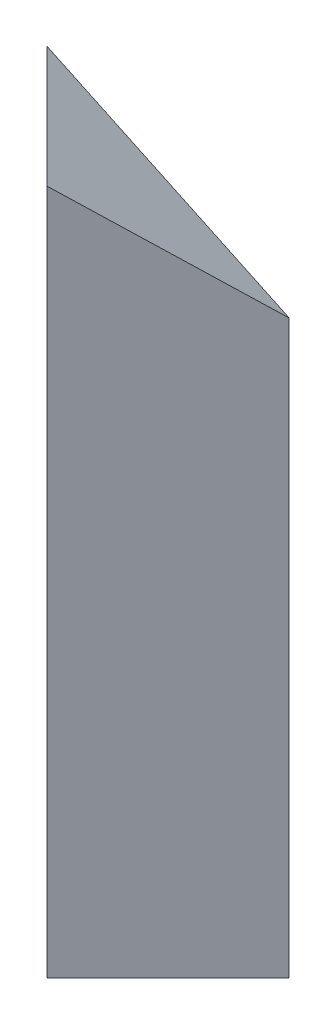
ISO-10303-21;
HEADER;
FILE_DESCRIPTION(('STEP AP214'),'2;1');
FILE_NAME('part.step','',(''),(''),'','','');
FILE_SCHEMA(('AUTOMOTIVE_DESIGN { 1 0 10303 214 1 1 1 1 }'));
ENDSEC;
DATA;
#1=APPLICATION_CONTEXT('core data for automotive mechanical design processes');
#2=APPLICATION_PROTOCOL_DEFINITION('international standard','automotive_design',2000,#1);
#3=PRODUCT_CONTEXT('',#1,'mechanical');
#4=PRODUCT('Part','Part','',(#3));
#5=PRODUCT_RELATED_PRODUCT_CATEGORY('part','',(#4));
#6=PRODUCT_DEFINITION_FORMATION('','',#4);
#7=PRODUCT_DEFINITION_CONTEXT('part definition',#1,'design');
#8=PRODUCT_DEFINITION('design','',#6,#7);
#9=PRODUCT_DEFINITION_SHAPE('','',#8);
#10=(LENGTH_UNIT() NAMED_UNIT(*) SI_UNIT(.MILLI.,.METRE.));
#11=(NAMED_UNIT(*) PLANE_ANGLE_UNIT() SI_UNIT($,.RADIAN.));
#12=(NAMED_UNIT(*) SI_UNIT($,.STERADIAN.) SOLID_ANGLE_UNIT());
#13=UNCERTAINTY_MEASURE_WITH_UNIT(LENGTH_MEASURE(1.E-05),#10,'distance_accuracy_value','');
#14=(GEOMETRIC_REPRESENTATION_CONTEXT(3) GLOBAL_UNCERTAINTY_ASSIGNED_CONTEXT((#13)) GLOBAL_UNIT_ASSIGNED_CONTEXT((#10,
#11,#12)) REPRESENTATION_CONTEXT('',''));
#15=CARTESIAN_POINT('',(0.,0.,0.));
#16=DIRECTION('',(0.,0.,1.));
#17=DIRECTION('',(1.,0.,0.));
#18=AXIS2_PLACEMENT_3D('',#15,#16,#17);
#19=CARTESIAN_POINT('',(-358.294753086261,26.8362503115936,79.0610038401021));
#20=DIRECTION('',(0.707106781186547,0.,0.707106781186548));
#21=DIRECTION('',(0.707106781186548,0.,-0.707106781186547));
#22=AXIS2_PLACEMENT_3D('',#19,#20,#21);
#23=PLANE('',#22);
#24=DIRECTION('',(-0.588348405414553,0.554700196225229,0.588348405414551));
#25=VECTOR('',#24,1.);
#26=CARTESIAN_POINT('',(-358.294753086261,26.8362503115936,79.0610038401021));
#27=LINE('',#26,#25);
#28=CARTESIAN_POINT('',(-354.759219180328,23.5029169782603,75.5254699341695));
#29=VERTEX_POINT('',#28);
#30=CARTESIAN_POINT('',(-358.294753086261,26.8362503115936,79.0610038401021));
#31=VERTEX_POINT('',#30);
#32=EDGE_CURVE('E34',#29,#31,#27,.T.);
#33=ORIENTED_EDGE('',*,*,#32,.T.);
#34=DIRECTION('',(0.,-1.,0.));
#35=VECTOR('',#34,1.);
#36=CARTESIAN_POINT('',(-358.294753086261,6.83625031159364,79.0610038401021));
#37=LINE('',#36,#35);
#38=CARTESIAN_POINT('',(-358.294753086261,6.83625031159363,79.0610038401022));
#39=VERTEX_POINT('',#38);
#40=EDGE_CURVE('E66',#31,#39,#37,.T.);
#41=ORIENTED_EDGE('',*,*,#40,.T.);
#42=DIRECTION('',(0.707106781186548,0.,-0.707106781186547));
#43=VECTOR('',#42,1.);
#44=CARTESIAN_POINT('',(-337.081549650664,6.83625031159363,57.8478004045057));
#45=LINE('',#44,#43);
#46=CARTESIAN_POINT('',(-354.759219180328,6.83625031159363,75.5254699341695));
#47=VERTEX_POINT('',#46);
#48=EDGE_CURVE('E59',#39,#47,#45,.T.);
#49=ORIENTED_EDGE('',*,*,#48,.T.);
#50=DIRECTION('',(0.,1.,0.));
#51=VECTOR('',#50,1.);
#52=CARTESIAN_POINT('',(-354.759219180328,15.6636709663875,75.5254699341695));
#53=LINE('',#52,#51);
#54=EDGE_CURVE('E49',#47,#29,#53,.T.);
#55=ORIENTED_EDGE('',*,*,#54,.T.);
#56=EDGE_LOOP('',(#33,#41,#49,#55));
#57=FACE_BOUND('',#56,.T.);
#58=ADVANCED_FACE('F31',(#57),#23,.T.);
#59=CARTESIAN_POINT('',(-358.294753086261,26.8362503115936,79.0610038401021));
#60=DIRECTION('',(-0.392232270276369,-0.832050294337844,0.392232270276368));
#61=DIRECTION('',(0.904534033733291,-0.426401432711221,0.));
#62=AXIS2_PLACEMENT_3D('',#59,#60,#61);
#63=PLANE('',#62);
#64=ORIENTED_EDGE('',*,*,#32,.F.);
#65=DIRECTION('',(0.904533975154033,-0.426401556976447,-3.22185604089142E-07));
#66=VECTOR('',#65,1.);
#67=CARTESIAN_POINT('',(-361.830284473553,26.8362503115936,75.5254724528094));
#68=LINE('',#67,#66);
#69=CARTESIAN_POINT('',(-361.830284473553,26.8362503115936,75.5254724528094));
#70=VERTEX_POINT('',#69);
#71=EDGE_CURVE('E80',#70,#29,#68,.T.);
#72=ORIENTED_EDGE('',*,*,#71,.F.);
#73=DIRECTION('',(-0.707106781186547,0.,-0.707106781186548));
#74=VECTOR('',#73,1.);
#75=CARTESIAN_POINT('',(-356.173432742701,26.8362503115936,81.1823241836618));
#76=LINE('',#75,#74);
#77=EDGE_CURVE('E71',#31,#70,#76,.T.);
#78=ORIENTED_EDGE('',*,*,#77,.F.);
#79=EDGE_LOOP('',(#64,#72,#78));
#80=FACE_BOUND('',#79,.T.);
#81=ADVANCED_FACE('F79',(#80),#63,.F.);
#82=CARTESIAN_POINT('',(-356.173432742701,6.83625031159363,81.1823241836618));
#83=DIRECTION('',(0.707106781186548,0.,-0.707106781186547));
#84=DIRECTION('',(-0.707106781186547,0.,-0.707106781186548));
#85=AXIS2_PLACEMENT_3D('',#82,#83,#84);
#86=PLANE('',#85);
#87=ORIENTED_EDGE('',*,*,#40,.F.);
#88=ORIENTED_EDGE('',*,*,#77,.T.);
#89=DIRECTION('',(0.,-1.,0.));
#90=VECTOR('',#89,1.);
#91=CARTESIAN_POINT('',(-361.830286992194,6.83625031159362,75.5254699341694));
#92=LINE('',#91,#90);
#93=CARTESIAN_POINT('',(-361.830286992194,6.83625031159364,75.5254699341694));
#94=VERTEX_POINT('',#93);
#95=EDGE_CURVE('E40',#70,#94,#92,.T.);
#96=ORIENTED_EDGE('',*,*,#95,.T.);
#97=DIRECTION('',(0.707106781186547,0.,0.707106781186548));
#98=VECTOR('',#97,1.);
#99=CARTESIAN_POINT('',(-356.173432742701,6.83625031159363,81.1823241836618));
#100=LINE('',#99,#98);
#101=EDGE_CURVE('E73',#94,#39,#100,.T.);
#102=ORIENTED_EDGE('',*,*,#101,.T.);
#103=EDGE_LOOP('',(#87,#88,#96,#102));
#104=FACE_BOUND('',#103,.T.);
#105=ADVANCED_FACE('F68',(#104),#86,.F.);
#106=CARTESIAN_POINT('',(-358.294753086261,6.83625031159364,79.0610038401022));
#107=DIRECTION('',(0.,-1.,0.));
#108=DIRECTION('',(1.,0.,0.));
#109=AXIS2_PLACEMENT_3D('',#106,#107,#108);
#110=PLANE('',#109);
#111=ORIENTED_EDGE('',*,*,#48,.F.);
#112=ORIENTED_EDGE('',*,*,#101,.F.);
#113=DIRECTION('',(1.,0.,0.));
#114=VECTOR('',#113,1.);
#115=CARTESIAN_POINT('',(-361.830286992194,6.83625031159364,75.5254699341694));
#116=LINE('',#115,#114);
#117=EDGE_CURVE('E11',#94,#47,#116,.T.);
#118=ORIENTED_EDGE('',*,*,#117,.T.);
#119=EDGE_LOOP('',(#111,#112,#118));
#120=FACE_BOUND('',#119,.T.);
#121=ADVANCED_FACE('F87',(#120),#110,.T.);
#122=CARTESIAN_POINT('',(-358.294753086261,6.83625031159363,75.5254699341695));
#123=DIRECTION('',(1.61904333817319E-07,-6.86901930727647E-08,0.999999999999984));
#124=DIRECTION('',(0.999999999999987,0.,-1.61904333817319E-07));
#125=AXIS2_PLACEMENT_3D('',#122,#123,#124);
#126=PLANE('',#125);
#127=ORIENTED_EDGE('',*,*,#54,.F.);
#128=ORIENTED_EDGE('',*,*,#117,.F.);
#129=ORIENTED_EDGE('',*,*,#95,.F.);
#130=ORIENTED_EDGE('',*,*,#71,.T.);
#131=EDGE_LOOP('',(#127,#128,#129,#130));
#132=FACE_BOUND('',#131,.T.);
#133=ADVANCED_FACE('F86',(#132),#126,.F.);
#134=CLOSED_SHELL('',(#58,#81,#105,#121,#133));
#135=MANIFOLD_SOLID_BREP('B2',#134);
#136=ADVANCED_BREP_SHAPE_REPRESENTATION('',(#18,#135),#14);
#137=SHAPE_DEFINITION_REPRESENTATION(#9,#136);
ENDSEC;
END-ISO-10303-21;
